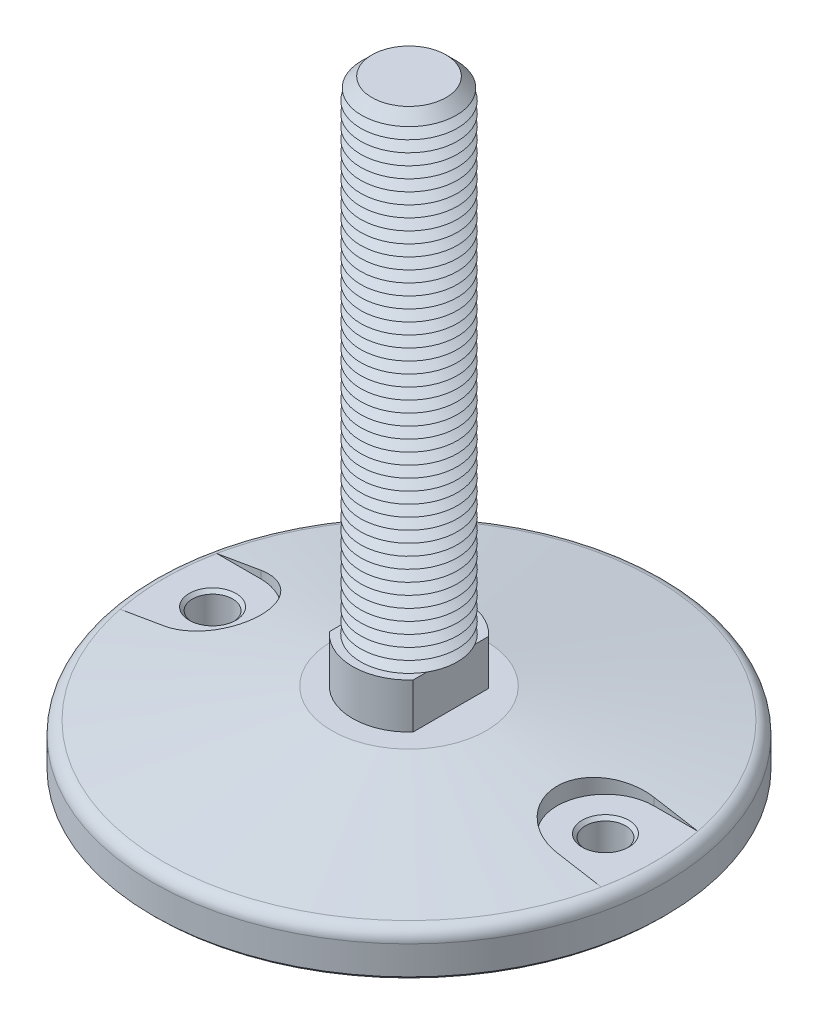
from build123d import *

# Parameters (mm, degrees)
FILLET1_R                = 4
SKETCH3_R                = 17.5
BOSS_EXTRUDE1_DEPTH      = 14
CUT_EXTRUDE1_START       = -14
CUT_EXTRUDE1_DEPTH       = 14
SKETCH5_R                = 15
BOSS_EXTRUDE2_DEPTH      = 150
CHAMFER1_SIZE            = 3.5
LPATTERN1_COUNT          = 42
LPATTERN1_PITCH          = 3.5
CUT_EXTRUDE4_DEPTH       = 9.2
SKETCH10_R               = 6.25
CUT_EXTRUDE5_DEPTH       = 13.8
CHAMFER2_SIZE            = 1
CHAMFER2_OF_MIRROR1_SIZE = 1
CHAMFER3_SIZE            = 1


with BuildPart() as part:
    # Sketch2 → Revolve1 (revolve)
    with BuildSketch(Plane(origin=(0, 0, 0), x_dir=(0, 0, -1), z_dir=(1, 0, 0)), mode=Mode.PRIVATE) as revolve1_sk:
        Polygon((0, 0), (-24, 0), (-79.5, -9.786147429), (-79.5, -23), (0, -23), align=None)
    revolve(revolve1_sk.sketch.rotate(Axis((0, 61.338865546, 0), (0, -1, 0)), 180), axis=Axis((0, 61.338865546, 0), (0, -1, 0)))

    # Fillet1
    fillet1_edges = [part.edges().sort_by_distance(p)[0] for p in [
        (0, -9.786147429, 79.5),
    ]]
    fillet(fillet1_edges, radius=FILLET1_R)

    # Sketch3 → Boss-Extrude1 (add)
    with BuildSketch(Plane(origin=(0, 0, 0), x_dir=(1, 0, 0), z_dir=(0, 1, 0))):
        with Locations(Location((0, 0, 0), (0, 0, 270))):
            Circle(SKETCH3_R)
    extrude(amount=BOSS_EXTRUDE1_DEPTH)

    # Sketch4 → Cut-Extrude1 (cut)
    with BuildSketch(Plane(origin=(0, 14, 0), x_dir=(1, 0, 0), z_dir=(0, 1, 0)).offset(CUT_EXTRUDE1_START)):
        with BuildLine():
            Line((-13, 11.715374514), (-13, -11.715374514))
            ThreePointArc((-13, -11.715374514), (-17.5, 0), (-13, 11.715374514))
        make_face()
        with BuildLine():
            Line((13, -11.715374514), (13, 11.715374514))
            ThreePointArc((13, 11.715374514), (17.5, 0), (13, -11.715374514))
        make_face()
    extrude(amount=CUT_EXTRUDE1_DEPTH, mode=Mode.SUBTRACT)

    # Sketch5 → Boss-Extrude2 (add)
    with BuildSketch(Plane(origin=(0, 14, 0), x_dir=(1, 0, 0), z_dir=(0, 1, 0))):
        with Locations(Location((0, 0, 0), (0, 0, 29.926434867))):
            Circle(SKETCH5_R)
    extrude(amount=BOSS_EXTRUDE2_DEPTH)

    # Chamfer1
    chamfer1_edges = [part.edges().sort_by_distance(p)[0] for p in [
        (-13, 164, 7.483314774),
    ]]
    chamfer(chamfer1_edges, length=CHAMFER1_SIZE)

    # Sketch6 → Cut-Revolve1 (revolve, cut)
    with BuildSketch(Plane(origin=(0, 0, 0), x_dir=(0, 0, -1), z_dir=(1, 0, 0)), mode=Mode.PRIVATE) as cut_revolve1_sk:
        Polygon((-15, 14), (-11.968911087, 15.75), (-15, 17.5), align=None)
    cut_revolve1 = revolve(cut_revolve1_sk.sketch.rotate(Axis((0, 61.338865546, 0), (0, -1, 0)), 180), axis=Axis((0, 61.338865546, 0), (0, -1, 0)), mode=Mode.SUBTRACT)

    # LPattern1: Cut-Revolve1 ×42
    with Locations(*[(0, i * LPATTERN1_PITCH, 0) for i in range(1, LPATTERN1_COUNT)]):
        add(cut_revolve1, mode=Mode.SUBTRACT)

    # Sketch8 → Cut-Extrude4 (cut)
    with BuildSketch(Plane(origin=(0, 0, 0), x_dir=(1, 0, 0), z_dir=(0, 1, 0))):
        with BuildLine():
            Line((-61, 15), (-74.703520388, 15))
            ThreePointArc((-74.703520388, 15), (-76.194592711, 0), (-74.703520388, -15))
            Line((-74.703520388, -15), (-61, -15))
            ThreePointArc((-61, -15), (-46, 0), (-61, 15))
        make_face()
    cut_extrude4 = extrude(amount=-CUT_EXTRUDE4_DEPTH, mode=Mode.SUBTRACT)

    # Sketch10 → Cut-Extrude5 (cut)
    with BuildSketch(Plane(origin=(0, -9.2, 0), x_dir=(1, 0, 0), z_dir=(0, 1, 0))):
        with Locations(Location((-61, 0, 0), (0, 0, 270))):
            Circle(SKETCH10_R)
    cut_extrude5 = extrude(amount=-CUT_EXTRUDE5_DEPTH, mode=Mode.SUBTRACT)

    # Chamfer2
    chamfer2_edges = [part.edges().sort_by_distance(p)[0] for p in [
        (-61, -9.2, -6.25),
        (-61, -23, -6.25),
    ]]
    chamfer(chamfer2_edges, length=CHAMFER2_SIZE)

    # Mirror1: Cut-Extrude4, Cut-Extrude5 across plane
    add(cut_extrude4.mirror(Plane(origin=(0, 0, 0), x_dir=(0, 0, 1), z_dir=(1, 0, 0))), mode=Mode.SUBTRACT)
    add(cut_extrude5.mirror(Plane(origin=(0, 0, 0), x_dir=(0, 0, 1), z_dir=(1, 0, 0))), mode=Mode.SUBTRACT)

    # Chamfer2 of Mirror1
    chamfer2_of_mirror1_edges = [part.edges().sort_by_distance(p)[0] for p in [
        (61, -9.2, -6.25),
        (61, -23, -6.25),
    ]]
    chamfer(chamfer2_of_mirror1_edges, length=CHAMFER2_OF_MIRROR1_SIZE)

    # Chamfer3
    chamfer3_edges = [part.edges().sort_by_distance(p)[0] for p in [
        (0, -23, 79.5),
    ]]
    chamfer(chamfer3_edges, length=CHAMFER3_SIZE)


solid = part.part
